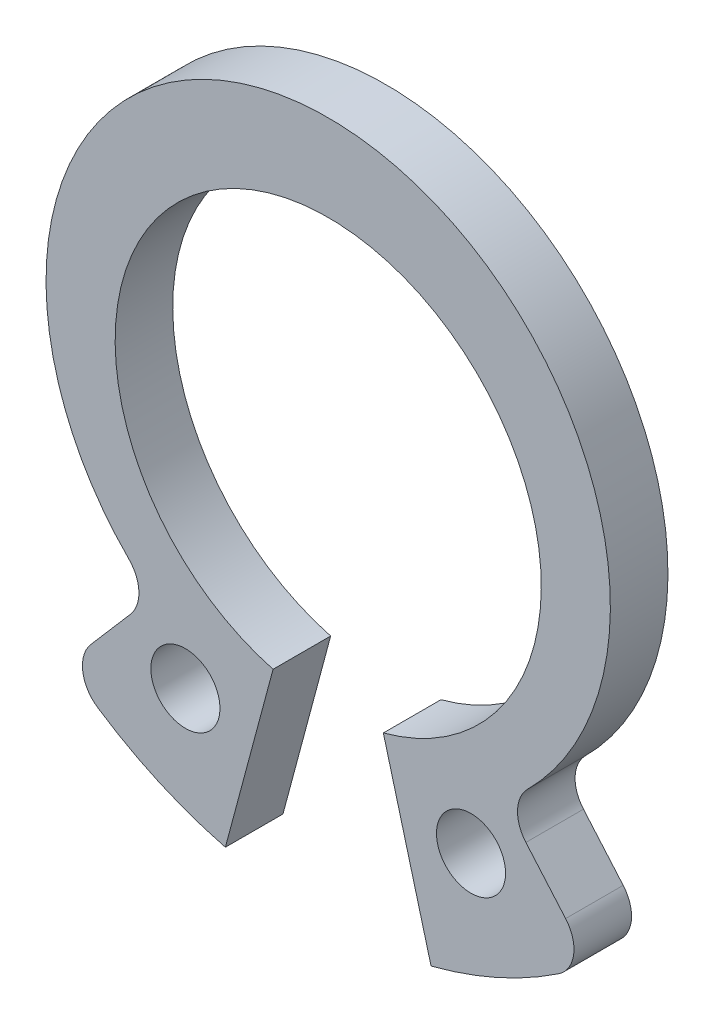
ISO-10303-21;
HEADER;
FILE_DESCRIPTION(('STEP AP214'),'2;1');
FILE_NAME('part.step','',(''),(''),'','','');
FILE_SCHEMA(('AUTOMOTIVE_DESIGN { 1 0 10303 214 1 1 1 1 }'));
ENDSEC;
DATA;
#1=APPLICATION_CONTEXT('core data for automotive mechanical design processes');
#2=APPLICATION_PROTOCOL_DEFINITION('international standard','automotive_design',2000,#1);
#3=PRODUCT_CONTEXT('',#1,'mechanical');
#4=PRODUCT('Part','Part','',(#3));
#5=PRODUCT_RELATED_PRODUCT_CATEGORY('part','',(#4));
#6=PRODUCT_DEFINITION_FORMATION('','',#4);
#7=PRODUCT_DEFINITION_CONTEXT('part definition',#1,'design');
#8=PRODUCT_DEFINITION('design','',#6,#7);
#9=PRODUCT_DEFINITION_SHAPE('','',#8);
#10=(LENGTH_UNIT() NAMED_UNIT(*) SI_UNIT(.MILLI.,.METRE.));
#11=(NAMED_UNIT(*) PLANE_ANGLE_UNIT() SI_UNIT($,.RADIAN.));
#12=(NAMED_UNIT(*) SI_UNIT($,.STERADIAN.) SOLID_ANGLE_UNIT());
#13=UNCERTAINTY_MEASURE_WITH_UNIT(LENGTH_MEASURE(1.E-05),#10,'distance_accuracy_value','');
#14=(GEOMETRIC_REPRESENTATION_CONTEXT(3) GLOBAL_UNCERTAINTY_ASSIGNED_CONTEXT((#13)) GLOBAL_UNIT_ASSIGNED_CONTEXT((#10,
#11,#12)) REPRESENTATION_CONTEXT('',''));
#15=CARTESIAN_POINT('',(0.,0.,0.));
#16=DIRECTION('',(0.,0.,1.));
#17=DIRECTION('',(1.,0.,0.));
#18=AXIS2_PLACEMENT_3D('',#15,#16,#17);
#19=CARTESIAN_POINT('',(-3.88705054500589,-3.59112298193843,1.));
#20=DIRECTION('',(0.,0.,-1.));
#21=DIRECTION('',(-1.,0.,0.));
#22=AXIS2_PLACEMENT_3D('',#19,#20,#21);
#23=PLANE('',#22);
#24=CARTESIAN_POINT('',(2.4797895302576,-4.62373948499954,1.));
#25=DIRECTION('',(0.,0.,1.));
#26=DIRECTION('',(1.,0.,0.));
#27=AXIS2_PLACEMENT_3D('',#24,#25,#26);
#28=CIRCLE('',#27,0.6);
#29=CARTESIAN_POINT('',(3.0797895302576,-4.62373948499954,1.));
#30=VERTEX_POINT('',#29);
#31=EDGE_CURVE('E458',#30,#30,#28,.T.);
#32=ORIENTED_EDGE('',*,*,#31,.F.);
#33=EDGE_LOOP('',(#32));
#34=FACE_BOUND('',#33,.T.);
#35=CARTESIAN_POINT('',(-3.88705054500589,-3.59112298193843,1.));
#36=DIRECTION('',(0.,0.,-1.));
#37=DIRECTION('',(-1.,0.,0.));
#38=AXIS2_PLACEMENT_3D('',#35,#36,#37);
#39=CIRCLE('',#38,0.599999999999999);
#40=CARTESIAN_POINT('',(-3.46300866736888,-3.16663683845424,1.));
#41=VERTEX_POINT('',#40);
#42=CARTESIAN_POINT('',(-3.43255273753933,-3.98282662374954,1.));
#43=VERTEX_POINT('',#42);
#44=EDGE_CURVE('E484',#41,#43,#39,.T.);
#45=ORIENTED_EDGE('',*,*,#44,.T.);
#46=DIRECTION('',(-0.652839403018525,-0.757496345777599,0.));
#47=VECTOR('',#46,1.);
#48=CARTESIAN_POINT('',(-3.43255273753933,-3.98282662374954,1.));
#49=LINE('',#48,#47);
#50=CARTESIAN_POINT('',(-4.12249600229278,-4.78337496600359,1.));
#51=VERTEX_POINT('',#50);
#52=EDGE_CURVE('E453',#43,#51,#49,.T.);
#53=ORIENTED_EDGE('',*,*,#52,.T.);
#54=CARTESIAN_POINT('',(-3.66799819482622,-5.17507860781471,1.));
#55=DIRECTION('',(0.,0.,1.));
#56=DIRECTION('',(-1.,0.,0.));
#57=AXIS2_PLACEMENT_3D('',#54,#55,#56);
#58=CIRCLE('',#57,0.600000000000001);
#59=CARTESIAN_POINT('',(-4.00194859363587,-5.67355341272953,1.));
#60=VERTEX_POINT('',#59);
#61=EDGE_CURVE('E487',#51,#60,#58,.T.);
#62=ORIENTED_EDGE('',*,*,#61,.T.);
#63=CARTESIAN_POINT('',(0.,0.3,1.));
#64=DIRECTION('',(0.,0.,1.));
#65=DIRECTION('',(1.,0.,0.));
#66=AXIS2_PLACEMENT_3D('',#63,#64,#65);
#67=CIRCLE('',#66,7.19019700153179);
#68=CARTESIAN_POINT('',(-1.7858514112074,-6.66488820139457,1.));
#69=VERTEX_POINT('',#68);
#70=EDGE_CURVE('E489',#60,#69,#67,.T.);
#71=ORIENTED_EDGE('',*,*,#70,.T.);
#72=DIRECTION('',(0.258819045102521,0.965925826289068,0.));
#73=VECTOR('',#72,1.);
#74=CARTESIAN_POINT('',(-0.957630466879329,-3.57392555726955,1.));
#75=LINE('',#74,#73);
#76=CARTESIAN_POINT('',(-0.957630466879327,-3.57392555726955,1.));
#77=VERTEX_POINT('',#76);
#78=EDGE_CURVE('E491',#69,#77,#75,.T.);
#79=ORIENTED_EDGE('',*,*,#78,.T.);
#80=CARTESIAN_POINT('',(0.,0.,1.));
#81=DIRECTION('',(0.,0.,-1.));
#82=DIRECTION('',(1.,0.,0.));
#83=AXIS2_PLACEMENT_3D('',#80,#81,#82);
#84=CIRCLE('',#83,3.7);
#85=CARTESIAN_POINT('',(0.957630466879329,-3.57392555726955,1.));
#86=VERTEX_POINT('',#85);
#87=EDGE_CURVE('E493',#77,#86,#84,.T.);
#88=ORIENTED_EDGE('',*,*,#87,.T.);
#89=DIRECTION('',(0.258819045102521,-0.965925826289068,0.));
#90=VECTOR('',#89,1.);
#91=CARTESIAN_POINT('',(0.957630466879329,-3.57392555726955,1.));
#92=LINE('',#91,#90);
#93=CARTESIAN_POINT('',(1.7858514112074,-6.66488820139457,1.));
#94=VERTEX_POINT('',#93);
#95=EDGE_CURVE('E495',#86,#94,#92,.T.);
#96=ORIENTED_EDGE('',*,*,#95,.T.);
#97=CARTESIAN_POINT('',(0.,0.3,1.));
#98=DIRECTION('',(0.,0.,1.));
#99=DIRECTION('',(1.,0.,0.));
#100=AXIS2_PLACEMENT_3D('',#97,#98,#99);
#101=CIRCLE('',#100,7.19019700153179);
#102=CARTESIAN_POINT('',(4.00194859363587,-5.67355341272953,1.));
#103=VERTEX_POINT('',#102);
#104=EDGE_CURVE('E497',#94,#103,#101,.T.);
#105=ORIENTED_EDGE('',*,*,#104,.T.);
#106=CARTESIAN_POINT('',(3.66799819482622,-5.17507860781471,1.));
#107=DIRECTION('',(0.,0.,1.));
#108=DIRECTION('',(1.,0.,0.));
#109=AXIS2_PLACEMENT_3D('',#106,#107,#108);
#110=CIRCLE('',#109,0.600000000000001);
#111=CARTESIAN_POINT('',(4.12249600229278,-4.78337496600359,1.));
#112=VERTEX_POINT('',#111);
#113=EDGE_CURVE('E499',#103,#112,#110,.T.);
#114=ORIENTED_EDGE('',*,*,#113,.T.);
#115=DIRECTION('',(-0.652839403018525,0.757496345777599,0.));
#116=VECTOR('',#115,1.);
#117=CARTESIAN_POINT('',(3.43255273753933,-3.98282662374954,1.));
#118=LINE('',#117,#116);
#119=CARTESIAN_POINT('',(3.43255273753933,-3.98282662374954,1.));
#120=VERTEX_POINT('',#119);
#121=EDGE_CURVE('E501',#112,#120,#118,.T.);
#122=ORIENTED_EDGE('',*,*,#121,.T.);
#123=CARTESIAN_POINT('',(3.88705054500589,-3.59112298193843,1.));
#124=DIRECTION('',(0.,0.,-1.));
#125=DIRECTION('',(1.,0.,0.));
#126=AXIS2_PLACEMENT_3D('',#123,#124,#125);
#127=CIRCLE('',#126,0.599999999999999);
#128=CARTESIAN_POINT('',(3.46300866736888,-3.16663683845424,1.));
#129=VERTEX_POINT('',#128);
#130=EDGE_CURVE('E370',#120,#129,#127,.T.);
#131=ORIENTED_EDGE('',*,*,#130,.T.);
#132=CARTESIAN_POINT('',(0.,0.3,1.));
#133=DIRECTION('',(0.,0.,1.));
#134=DIRECTION('',(1.,0.,0.));
#135=AXIS2_PLACEMENT_3D('',#132,#133,#134);
#136=CIRCLE('',#135,4.9);
#137=EDGE_CURVE('E365',#129,#41,#136,.T.);
#138=ORIENTED_EDGE('',*,*,#137,.T.);
#139=EDGE_LOOP('',(#45,#53,#62,#71,#79,#88,#96,#105,#114,#122,#131,#138));
#140=FACE_BOUND('',#139,.T.);
#141=CARTESIAN_POINT('',(-2.4797895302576,-4.62373948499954,1.));
#142=DIRECTION('',(0.,0.,1.));
#143=DIRECTION('',(-1.,0.,0.));
#144=AXIS2_PLACEMENT_3D('',#141,#142,#143);
#145=CIRCLE('',#144,0.6);
#146=CARTESIAN_POINT('',(-3.0797895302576,-4.62373948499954,1.));
#147=VERTEX_POINT('',#146);
#148=EDGE_CURVE('E604',#147,#147,#145,.T.);
#149=ORIENTED_EDGE('',*,*,#148,.F.);
#150=EDGE_LOOP('',(#149));
#151=FACE_BOUND('',#150,.T.);
#152=ADVANCED_FACE('F350',(#34,#140,#151),#23,.F.);
#153=CARTESIAN_POINT('',(-3.88705054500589,-3.59112298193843,0.));
#154=DIRECTION('',(0.,0.,-1.));
#155=DIRECTION('',(-1.,0.,0.));
#156=AXIS2_PLACEMENT_3D('',#153,#154,#155);
#157=PLANE('',#156);
#158=CARTESIAN_POINT('',(2.4797895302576,-4.62373948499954,0.));
#159=DIRECTION('',(0.,0.,1.));
#160=DIRECTION('',(1.,0.,0.));
#161=AXIS2_PLACEMENT_3D('',#158,#159,#160);
#162=CIRCLE('',#161,0.6);
#163=CARTESIAN_POINT('',(3.0797895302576,-4.62373948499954,0.));
#164=VERTEX_POINT('',#163);
#165=EDGE_CURVE('E461',#164,#164,#162,.T.);
#166=ORIENTED_EDGE('',*,*,#165,.T.);
#167=EDGE_LOOP('',(#166));
#168=FACE_BOUND('',#167,.T.);
#169=CARTESIAN_POINT('',(-3.88705054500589,-3.59112298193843,0.));
#170=DIRECTION('',(0.,0.,-1.));
#171=DIRECTION('',(-1.,0.,0.));
#172=AXIS2_PLACEMENT_3D('',#169,#170,#171);
#173=CIRCLE('',#172,0.599999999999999);
#174=CARTESIAN_POINT('',(-3.46300866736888,-3.16663683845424,0.));
#175=VERTEX_POINT('',#174);
#176=CARTESIAN_POINT('',(-3.43255273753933,-3.98282662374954,0.));
#177=VERTEX_POINT('',#176);
#178=EDGE_CURVE('E444',#175,#177,#173,.T.);
#179=ORIENTED_EDGE('',*,*,#178,.F.);
#180=CARTESIAN_POINT('',(0.,0.3,0.));
#181=DIRECTION('',(0.,0.,1.));
#182=DIRECTION('',(1.,0.,0.));
#183=AXIS2_PLACEMENT_3D('',#180,#181,#182);
#184=CIRCLE('',#183,4.9);
#185=CARTESIAN_POINT('',(3.46300866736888,-3.16663683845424,0.));
#186=VERTEX_POINT('',#185);
#187=EDGE_CURVE('E482',#186,#175,#184,.T.);
#188=ORIENTED_EDGE('',*,*,#187,.F.);
#189=CARTESIAN_POINT('',(3.88705054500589,-3.59112298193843,0.));
#190=DIRECTION('',(0.,0.,-1.));
#191=DIRECTION('',(1.,0.,0.));
#192=AXIS2_PLACEMENT_3D('',#189,#190,#191);
#193=CIRCLE('',#192,0.599999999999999);
#194=CARTESIAN_POINT('',(3.43255273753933,-3.98282662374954,0.));
#195=VERTEX_POINT('',#194);
#196=EDGE_CURVE('E480',#195,#186,#193,.T.);
#197=ORIENTED_EDGE('',*,*,#196,.F.);
#198=DIRECTION('',(-0.652839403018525,0.757496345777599,0.));
#199=VECTOR('',#198,1.);
#200=CARTESIAN_POINT('',(3.43255273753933,-3.98282662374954,0.));
#201=LINE('',#200,#199);
#202=CARTESIAN_POINT('',(4.12249600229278,-4.78337496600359,0.));
#203=VERTEX_POINT('',#202);
#204=EDGE_CURVE('E478',#203,#195,#201,.T.);
#205=ORIENTED_EDGE('',*,*,#204,.F.);
#206=CARTESIAN_POINT('',(3.66799819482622,-5.17507860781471,0.));
#207=DIRECTION('',(0.,0.,1.));
#208=DIRECTION('',(1.,0.,0.));
#209=AXIS2_PLACEMENT_3D('',#206,#207,#208);
#210=CIRCLE('',#209,0.600000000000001);
#211=CARTESIAN_POINT('',(4.00194859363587,-5.67355341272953,0.));
#212=VERTEX_POINT('',#211);
#213=EDGE_CURVE('E476',#212,#203,#210,.T.);
#214=ORIENTED_EDGE('',*,*,#213,.F.);
#215=CARTESIAN_POINT('',(0.,0.3,0.));
#216=DIRECTION('',(0.,0.,1.));
#217=DIRECTION('',(1.,0.,0.));
#218=AXIS2_PLACEMENT_3D('',#215,#216,#217);
#219=CIRCLE('',#218,7.19019700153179);
#220=CARTESIAN_POINT('',(1.7858514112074,-6.66488820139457,0.));
#221=VERTEX_POINT('',#220);
#222=EDGE_CURVE('E474',#221,#212,#219,.T.);
#223=ORIENTED_EDGE('',*,*,#222,.F.);
#224=DIRECTION('',(0.258819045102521,-0.965925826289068,0.));
#225=VECTOR('',#224,1.);
#226=CARTESIAN_POINT('',(0.957630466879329,-3.57392555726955,0.));
#227=LINE('',#226,#225);
#228=CARTESIAN_POINT('',(0.957630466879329,-3.57392555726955,0.));
#229=VERTEX_POINT('',#228);
#230=EDGE_CURVE('E472',#229,#221,#227,.T.);
#231=ORIENTED_EDGE('',*,*,#230,.F.);
#232=CARTESIAN_POINT('',(0.,0.,0.));
#233=DIRECTION('',(0.,0.,-1.));
#234=DIRECTION('',(1.,0.,0.));
#235=AXIS2_PLACEMENT_3D('',#232,#233,#234);
#236=CIRCLE('',#235,3.7);
#237=CARTESIAN_POINT('',(-0.957630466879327,-3.57392555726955,0.));
#238=VERTEX_POINT('',#237);
#239=EDGE_CURVE('E470',#238,#229,#236,.T.);
#240=ORIENTED_EDGE('',*,*,#239,.F.);
#241=DIRECTION('',(0.258819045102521,0.965925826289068,0.));
#242=VECTOR('',#241,1.);
#243=CARTESIAN_POINT('',(-0.957630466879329,-3.57392555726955,0.));
#244=LINE('',#243,#242);
#245=CARTESIAN_POINT('',(-1.7858514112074,-6.66488820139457,0.));
#246=VERTEX_POINT('',#245);
#247=EDGE_CURVE('E468',#246,#238,#244,.T.);
#248=ORIENTED_EDGE('',*,*,#247,.F.);
#249=CARTESIAN_POINT('',(0.,0.3,0.));
#250=DIRECTION('',(0.,0.,1.));
#251=DIRECTION('',(1.,0.,0.));
#252=AXIS2_PLACEMENT_3D('',#249,#250,#251);
#253=CIRCLE('',#252,7.19019700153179);
#254=CARTESIAN_POINT('',(-4.00194859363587,-5.67355341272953,0.));
#255=VERTEX_POINT('',#254);
#256=EDGE_CURVE('E466',#255,#246,#253,.T.);
#257=ORIENTED_EDGE('',*,*,#256,.F.);
#258=CARTESIAN_POINT('',(-3.66799819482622,-5.17507860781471,0.));
#259=DIRECTION('',(0.,0.,1.));
#260=DIRECTION('',(-1.,0.,0.));
#261=AXIS2_PLACEMENT_3D('',#258,#259,#260);
#262=CIRCLE('',#261,0.600000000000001);
#263=CARTESIAN_POINT('',(-4.12249600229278,-4.78337496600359,0.));
#264=VERTEX_POINT('',#263);
#265=EDGE_CURVE('E446',#264,#255,#262,.T.);
#266=ORIENTED_EDGE('',*,*,#265,.F.);
#267=DIRECTION('',(-0.652839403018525,-0.757496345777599,0.));
#268=VECTOR('',#267,1.);
#269=CARTESIAN_POINT('',(-3.43255273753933,-3.98282662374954,0.));
#270=LINE('',#269,#268);
#271=EDGE_CURVE('E439',#177,#264,#270,.T.);
#272=ORIENTED_EDGE('',*,*,#271,.F.);
#273=EDGE_LOOP('',(#179,#188,#197,#205,#214,#223,#231,#240,#248,#257,#266,#272));
#274=FACE_BOUND('',#273,.T.);
#275=CARTESIAN_POINT('',(-2.4797895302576,-4.62373948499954,0.));
#276=DIRECTION('',(0.,0.,1.));
#277=DIRECTION('',(-1.,0.,0.));
#278=AXIS2_PLACEMENT_3D('',#275,#276,#277);
#279=CIRCLE('',#278,0.6);
#280=CARTESIAN_POINT('',(-3.0797895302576,-4.62373948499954,0.));
#281=VERTEX_POINT('',#280);
#282=EDGE_CURVE('E607',#281,#281,#279,.T.);
#283=ORIENTED_EDGE('',*,*,#282,.T.);
#284=EDGE_LOOP('',(#283));
#285=FACE_BOUND('',#284,.T.);
#286=ADVANCED_FACE('F440',(#168,#274,#285),#157,.T.);
#287=CARTESIAN_POINT('',(-3.88705054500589,-3.59112298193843,1.));
#288=DIRECTION('',(0.,0.,-1.));
#289=DIRECTION('',(-1.,0.,0.));
#290=AXIS2_PLACEMENT_3D('',#287,#288,#289);
#291=CYLINDRICAL_SURFACE('',#290,0.599999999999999);
#292=ORIENTED_EDGE('',*,*,#178,.T.);
#293=DIRECTION('',(0.,0.,-1.));
#294=VECTOR('',#293,1.);
#295=CARTESIAN_POINT('',(-3.43255273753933,-3.98282662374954,1.));
#296=LINE('',#295,#294);
#297=EDGE_CURVE('E11',#43,#177,#296,.T.);
#298=ORIENTED_EDGE('',*,*,#297,.F.);
#299=ORIENTED_EDGE('',*,*,#44,.F.);
#300=DIRECTION('',(0.,0.,-1.));
#301=VECTOR('',#300,1.);
#302=CARTESIAN_POINT('',(-3.46300866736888,-3.16663683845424,1.));
#303=LINE('',#302,#301);
#304=EDGE_CURVE('E457',#41,#175,#303,.T.);
#305=ORIENTED_EDGE('',*,*,#304,.T.);
#306=EDGE_LOOP('',(#292,#298,#299,#305));
#307=FACE_BOUND('',#306,.T.);
#308=ADVANCED_FACE('F352',(#307),#291,.F.);
#309=CARTESIAN_POINT('',(-3.43255273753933,-3.98282662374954,1.));
#310=DIRECTION('',(0.757496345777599,-0.652839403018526,0.));
#311=DIRECTION('',(0.652839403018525,0.757496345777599,0.));
#312=AXIS2_PLACEMENT_3D('',#309,#310,#311);
#313=PLANE('',#312);
#314=ORIENTED_EDGE('',*,*,#271,.T.);
#315=DIRECTION('',(0.,0.,-1.));
#316=VECTOR('',#315,1.);
#317=CARTESIAN_POINT('',(-4.12249600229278,-4.78337496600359,1.));
#318=LINE('',#317,#316);
#319=EDGE_CURVE('E358',#51,#264,#318,.T.);
#320=ORIENTED_EDGE('',*,*,#319,.F.);
#321=ORIENTED_EDGE('',*,*,#52,.F.);
#322=ORIENTED_EDGE('',*,*,#297,.T.);
#323=EDGE_LOOP('',(#314,#320,#321,#322));
#324=FACE_BOUND('',#323,.T.);
#325=ADVANCED_FACE('F452',(#324),#313,.F.);
#326=CARTESIAN_POINT('',(-3.66799819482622,-5.17507860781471,1.));
#327=DIRECTION('',(0.,0.,-1.));
#328=DIRECTION('',(-1.,0.,0.));
#329=AXIS2_PLACEMENT_3D('',#326,#327,#328);
#330=CYLINDRICAL_SURFACE('',#329,0.600000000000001);
#331=ORIENTED_EDGE('',*,*,#265,.T.);
#332=DIRECTION('',(0.,0.,-1.));
#333=VECTOR('',#332,1.);
#334=CARTESIAN_POINT('',(-4.00194859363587,-5.67355341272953,1.));
#335=LINE('',#334,#333);
#336=EDGE_CURVE('E530',#60,#255,#335,.T.);
#337=ORIENTED_EDGE('',*,*,#336,.F.);
#338=ORIENTED_EDGE('',*,*,#61,.F.);
#339=ORIENTED_EDGE('',*,*,#319,.T.);
#340=EDGE_LOOP('',(#331,#337,#338,#339));
#341=FACE_BOUND('',#340,.T.);
#342=ADVANCED_FACE('F534',(#341),#330,.T.);
#343=CARTESIAN_POINT('',(0.,0.3,1.));
#344=DIRECTION('',(0.,0.,-1.));
#345=DIRECTION('',(-1.,0.,0.));
#346=AXIS2_PLACEMENT_3D('',#343,#344,#345);
#347=CYLINDRICAL_SURFACE('',#346,7.19019700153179);
#348=ORIENTED_EDGE('',*,*,#256,.T.);
#349=DIRECTION('',(0.,0.,-1.));
#350=VECTOR('',#349,1.);
#351=CARTESIAN_POINT('',(-1.7858514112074,-6.66488820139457,1.));
#352=LINE('',#351,#350);
#353=EDGE_CURVE('E527',#69,#246,#352,.T.);
#354=ORIENTED_EDGE('',*,*,#353,.F.);
#355=ORIENTED_EDGE('',*,*,#70,.F.);
#356=ORIENTED_EDGE('',*,*,#336,.T.);
#357=EDGE_LOOP('',(#348,#354,#355,#356));
#358=FACE_BOUND('',#357,.T.);
#359=ADVANCED_FACE('F542',(#358),#347,.T.);
#360=CARTESIAN_POINT('',(-0.957630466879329,-3.57392555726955,1.));
#361=DIRECTION('',(-0.965925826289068,0.258819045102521,0.));
#362=DIRECTION('',(-0.258819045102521,-0.965925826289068,0.));
#363=AXIS2_PLACEMENT_3D('',#360,#361,#362);
#364=PLANE('',#363);
#365=ORIENTED_EDGE('',*,*,#247,.T.);
#366=DIRECTION('',(0.,0.,-1.));
#367=VECTOR('',#366,1.);
#368=CARTESIAN_POINT('',(-0.957630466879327,-3.57392555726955,1.));
#369=LINE('',#368,#367);
#370=EDGE_CURVE('E524',#77,#238,#369,.T.);
#371=ORIENTED_EDGE('',*,*,#370,.F.);
#372=ORIENTED_EDGE('',*,*,#78,.F.);
#373=ORIENTED_EDGE('',*,*,#353,.T.);
#374=EDGE_LOOP('',(#365,#371,#372,#373));
#375=FACE_BOUND('',#374,.T.);
#376=ADVANCED_FACE('F545',(#375),#364,.F.);
#377=CARTESIAN_POINT('',(0.,0.,1.));
#378=DIRECTION('',(0.,0.,-1.));
#379=DIRECTION('',(-1.,0.,0.));
#380=AXIS2_PLACEMENT_3D('',#377,#378,#379);
#381=CYLINDRICAL_SURFACE('',#380,3.7);
#382=ORIENTED_EDGE('',*,*,#239,.T.);
#383=DIRECTION('',(0.,0.,-1.));
#384=VECTOR('',#383,1.);
#385=CARTESIAN_POINT('',(0.957630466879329,-3.57392555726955,1.));
#386=LINE('',#385,#384);
#387=EDGE_CURVE('E521',#86,#229,#386,.T.);
#388=ORIENTED_EDGE('',*,*,#387,.F.);
#389=ORIENTED_EDGE('',*,*,#87,.F.);
#390=ORIENTED_EDGE('',*,*,#370,.T.);
#391=EDGE_LOOP('',(#382,#388,#389,#390));
#392=FACE_BOUND('',#391,.T.);
#393=ADVANCED_FACE('F550',(#392),#381,.F.);
#394=CARTESIAN_POINT('',(0.957630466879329,-3.57392555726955,1.));
#395=DIRECTION('',(0.965925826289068,0.258819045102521,0.));
#396=DIRECTION('',(-0.258819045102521,0.965925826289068,0.));
#397=AXIS2_PLACEMENT_3D('',#394,#395,#396);
#398=PLANE('',#397);
#399=ORIENTED_EDGE('',*,*,#230,.T.);
#400=DIRECTION('',(0.,0.,-1.));
#401=VECTOR('',#400,1.);
#402=CARTESIAN_POINT('',(1.7858514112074,-6.66488820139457,1.));
#403=LINE('',#402,#401);
#404=EDGE_CURVE('E518',#94,#221,#403,.T.);
#405=ORIENTED_EDGE('',*,*,#404,.F.);
#406=ORIENTED_EDGE('',*,*,#95,.F.);
#407=ORIENTED_EDGE('',*,*,#387,.T.);
#408=EDGE_LOOP('',(#399,#405,#406,#407));
#409=FACE_BOUND('',#408,.T.);
#410=ADVANCED_FACE('F556',(#409),#398,.F.);
#411=CARTESIAN_POINT('',(0.,0.3,1.));
#412=DIRECTION('',(0.,0.,-1.));
#413=DIRECTION('',(-1.,0.,0.));
#414=AXIS2_PLACEMENT_3D('',#411,#412,#413);
#415=CYLINDRICAL_SURFACE('',#414,7.19019700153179);
#416=ORIENTED_EDGE('',*,*,#222,.T.);
#417=DIRECTION('',(0.,0.,-1.));
#418=VECTOR('',#417,1.);
#419=CARTESIAN_POINT('',(4.00194859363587,-5.67355341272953,1.));
#420=LINE('',#419,#418);
#421=EDGE_CURVE('E515',#103,#212,#420,.T.);
#422=ORIENTED_EDGE('',*,*,#421,.F.);
#423=ORIENTED_EDGE('',*,*,#104,.F.);
#424=ORIENTED_EDGE('',*,*,#404,.T.);
#425=EDGE_LOOP('',(#416,#422,#423,#424));
#426=FACE_BOUND('',#425,.T.);
#427=ADVANCED_FACE('F560',(#426),#415,.T.);
#428=CARTESIAN_POINT('',(3.66799819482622,-5.17507860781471,1.));
#429=DIRECTION('',(0.,0.,-1.));
#430=DIRECTION('',(-1.,0.,0.));
#431=AXIS2_PLACEMENT_3D('',#428,#429,#430);
#432=CYLINDRICAL_SURFACE('',#431,0.600000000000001);
#433=ORIENTED_EDGE('',*,*,#213,.T.);
#434=DIRECTION('',(0.,0.,-1.));
#435=VECTOR('',#434,1.);
#436=CARTESIAN_POINT('',(4.12249600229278,-4.78337496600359,1.));
#437=LINE('',#436,#435);
#438=EDGE_CURVE('E512',#112,#203,#437,.T.);
#439=ORIENTED_EDGE('',*,*,#438,.F.);
#440=ORIENTED_EDGE('',*,*,#113,.F.);
#441=ORIENTED_EDGE('',*,*,#421,.T.);
#442=EDGE_LOOP('',(#433,#439,#440,#441));
#443=FACE_BOUND('',#442,.T.);
#444=ADVANCED_FACE('F565',(#443),#432,.T.);
#445=CARTESIAN_POINT('',(3.43255273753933,-3.98282662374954,1.));
#446=DIRECTION('',(-0.757496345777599,-0.652839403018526,0.));
#447=DIRECTION('',(0.652839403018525,-0.757496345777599,0.));
#448=AXIS2_PLACEMENT_3D('',#445,#446,#447);
#449=PLANE('',#448);
#450=ORIENTED_EDGE('',*,*,#204,.T.);
#451=DIRECTION('',(0.,0.,-1.));
#452=VECTOR('',#451,1.);
#453=CARTESIAN_POINT('',(3.43255273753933,-3.98282662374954,1.));
#454=LINE('',#453,#452);
#455=EDGE_CURVE('E509',#120,#195,#454,.T.);
#456=ORIENTED_EDGE('',*,*,#455,.F.);
#457=ORIENTED_EDGE('',*,*,#121,.F.);
#458=ORIENTED_EDGE('',*,*,#438,.T.);
#459=EDGE_LOOP('',(#450,#456,#457,#458));
#460=FACE_BOUND('',#459,.T.);
#461=ADVANCED_FACE('F569',(#460),#449,.F.);
#462=CARTESIAN_POINT('',(3.88705054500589,-3.59112298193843,1.));
#463=DIRECTION('',(0.,0.,-1.));
#464=DIRECTION('',(-1.,0.,0.));
#465=AXIS2_PLACEMENT_3D('',#462,#463,#464);
#466=CYLINDRICAL_SURFACE('',#465,0.599999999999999);
#467=ORIENTED_EDGE('',*,*,#196,.T.);
#468=DIRECTION('',(0.,0.,-1.));
#469=VECTOR('',#468,1.);
#470=CARTESIAN_POINT('',(3.46300866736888,-3.16663683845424,1.));
#471=LINE('',#470,#469);
#472=EDGE_CURVE('E506',#129,#186,#471,.T.);
#473=ORIENTED_EDGE('',*,*,#472,.F.);
#474=ORIENTED_EDGE('',*,*,#130,.F.);
#475=ORIENTED_EDGE('',*,*,#455,.T.);
#476=EDGE_LOOP('',(#467,#473,#474,#475));
#477=FACE_BOUND('',#476,.T.);
#478=ADVANCED_FACE('F573',(#477),#466,.F.);
#479=CARTESIAN_POINT('',(0.,0.3,1.));
#480=DIRECTION('',(0.,0.,-1.));
#481=DIRECTION('',(-1.,0.,0.));
#482=AXIS2_PLACEMENT_3D('',#479,#480,#481);
#483=CYLINDRICAL_SURFACE('',#482,4.9);
#484=ORIENTED_EDGE('',*,*,#187,.T.);
#485=ORIENTED_EDGE('',*,*,#304,.F.);
#486=ORIENTED_EDGE('',*,*,#137,.F.);
#487=ORIENTED_EDGE('',*,*,#472,.T.);
#488=EDGE_LOOP('',(#484,#485,#486,#487));
#489=FACE_BOUND('',#488,.T.);
#490=ADVANCED_FACE('F575',(#489),#483,.T.);
#491=CARTESIAN_POINT('',(2.4797895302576,-4.62373948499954,1.));
#492=DIRECTION('',(0.,0.,-1.));
#493=DIRECTION('',(-1.,0.,0.));
#494=AXIS2_PLACEMENT_3D('',#491,#492,#493);
#495=CYLINDRICAL_SURFACE('',#494,0.6);
#496=ORIENTED_EDGE('',*,*,#31,.T.);
#497=EDGE_LOOP('',(#496));
#498=FACE_BOUND('',#497,.T.);
#499=ORIENTED_EDGE('',*,*,#165,.F.);
#500=EDGE_LOOP('',(#499));
#501=FACE_BOUND('',#500,.T.);
#502=ADVANCED_FACE('F577',(#498,#501),#495,.F.);
#503=CARTESIAN_POINT('',(-2.4797895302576,-4.62373948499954,1.));
#504=DIRECTION('',(0.,0.,-1.));
#505=DIRECTION('',(-1.,0.,0.));
#506=AXIS2_PLACEMENT_3D('',#503,#504,#505);
#507=CYLINDRICAL_SURFACE('',#506,0.6);
#508=ORIENTED_EDGE('',*,*,#148,.T.);
#509=EDGE_LOOP('',(#508));
#510=FACE_BOUND('',#509,.T.);
#511=ORIENTED_EDGE('',*,*,#282,.F.);
#512=EDGE_LOOP('',(#511));
#513=FACE_BOUND('',#512,.T.);
#514=ADVANCED_FACE('F583',(#510,#513),#507,.F.);
#515=CLOSED_SHELL('',(#152,#286,#308,#325,#342,#359,#376,#393,#410,#427,#444,#461,#478,#490,
#502,#514));
#516=MANIFOLD_SOLID_BREP('B2',#515);
#517=ADVANCED_BREP_SHAPE_REPRESENTATION('',(#18,#516),#14);
#518=SHAPE_DEFINITION_REPRESENTATION(#9,#517);
ENDSEC;
END-ISO-10303-21;
